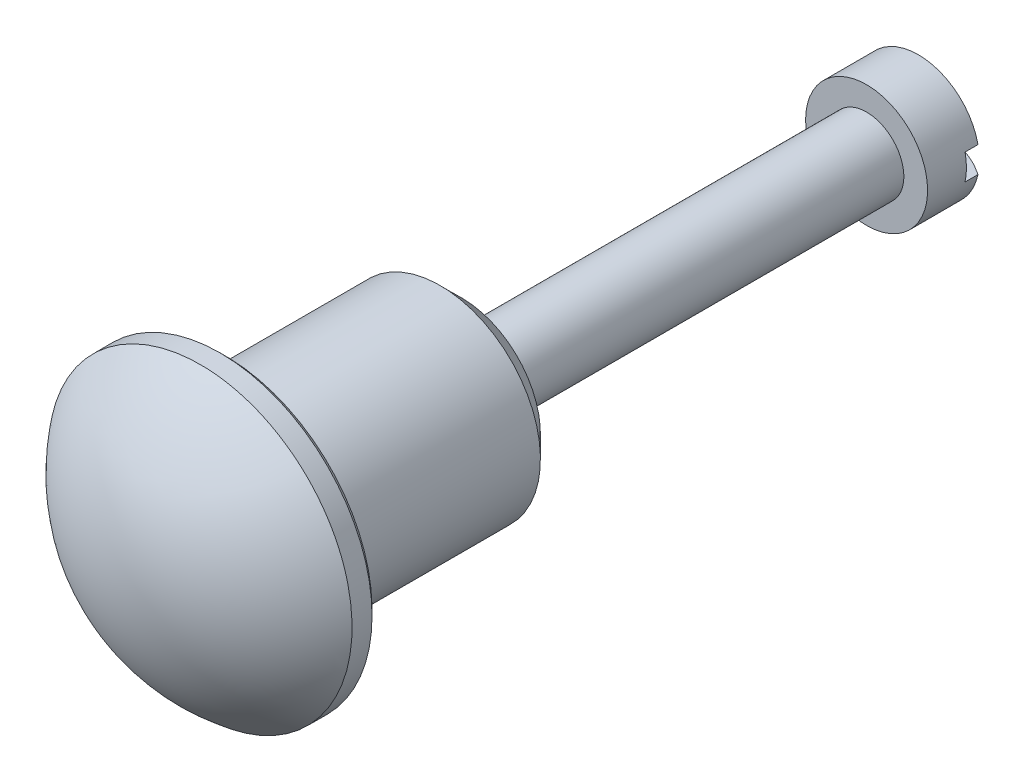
ISO-10303-21;
HEADER;
FILE_DESCRIPTION(('STEP AP214'),'2;1');
FILE_NAME('part.step','',(''),(''),'','','');
FILE_SCHEMA(('AUTOMOTIVE_DESIGN { 1 0 10303 214 1 1 1 1 }'));
ENDSEC;
DATA;
#1=APPLICATION_CONTEXT('core data for automotive mechanical design processes');
#2=APPLICATION_PROTOCOL_DEFINITION('international standard','automotive_design',2000,#1);
#3=PRODUCT_CONTEXT('',#1,'mechanical');
#4=PRODUCT('Part','Part','',(#3));
#5=PRODUCT_RELATED_PRODUCT_CATEGORY('part','',(#4));
#6=PRODUCT_DEFINITION_FORMATION('','',#4);
#7=PRODUCT_DEFINITION_CONTEXT('part definition',#1,'design');
#8=PRODUCT_DEFINITION('design','',#6,#7);
#9=PRODUCT_DEFINITION_SHAPE('','',#8);
#10=(LENGTH_UNIT() NAMED_UNIT(*) SI_UNIT(.MILLI.,.METRE.));
#11=(NAMED_UNIT(*) PLANE_ANGLE_UNIT() SI_UNIT($,.RADIAN.));
#12=(NAMED_UNIT(*) SI_UNIT($,.STERADIAN.) SOLID_ANGLE_UNIT());
#13=UNCERTAINTY_MEASURE_WITH_UNIT(LENGTH_MEASURE(1.E-05),#10,'distance_accuracy_value','');
#14=(GEOMETRIC_REPRESENTATION_CONTEXT(3) GLOBAL_UNCERTAINTY_ASSIGNED_CONTEXT((#13)) GLOBAL_UNIT_ASSIGNED_CONTEXT((#10,
#11,#12)) REPRESENTATION_CONTEXT('',''));
#15=CARTESIAN_POINT('',(0.,0.,0.));
#16=DIRECTION('',(0.,0.,1.));
#17=DIRECTION('',(1.,0.,0.));
#18=AXIS2_PLACEMENT_3D('',#15,#16,#17);
#19=CARTESIAN_POINT('',(0.,0.,-4.17195564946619));
#20=DIRECTION('',(0.635838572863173,0.771822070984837,0.));
#21=DIRECTION('',(0.,0.,-1.));
#22=AXIS2_PLACEMENT_3D('',#19,#20,#21);
#23=SPHERICAL_SURFACE('',#22,8.93445564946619);
#24=CARTESIAN_POINT('',(0.,0.,1.1938));
#25=DIRECTION('',(0.,0.,1.));
#26=DIRECTION('',(-0.635838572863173,-0.771822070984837,0.));
#27=AXIS2_PLACEMENT_3D('',#24,#25,#26);
#28=CIRCLE('',#27,7.14375);
#29=CARTESIAN_POINT('',(-4.54227180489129,-5.51370391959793,1.1938));
#30=VERTEX_POINT('',#29);
#31=EDGE_CURVE('E126',#30,#30,#28,.F.);
#32=ORIENTED_EDGE('',*,*,#31,.F.);
#33=EDGE_LOOP('',(#32));
#34=FACE_BOUND('',#33,.T.);
#35=ADVANCED_FACE('F14',(#34),#23,.T.);
#36=CARTESIAN_POINT('',(0.,0.,4.7625));
#37=DIRECTION('',(0.,0.,1.));
#38=DIRECTION('',(-0.635838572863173,-0.771822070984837,0.));
#39=AXIS2_PLACEMENT_3D('',#36,#37,#38);
#40=CYLINDRICAL_SURFACE('',#39,7.14375);
#41=ORIENTED_EDGE('',*,*,#31,.T.);
#42=EDGE_LOOP('',(#41));
#43=FACE_BOUND('',#42,.T.);
#44=CARTESIAN_POINT('',(0.,0.,0.25400000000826));
#45=DIRECTION('',(0.,0.,1.));
#46=DIRECTION('',(-0.635838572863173,-0.771822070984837,0.));
#47=AXIS2_PLACEMENT_3D('',#44,#45,#46);
#48=CIRCLE('',#47,7.14375000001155);
#49=CARTESIAN_POINT('',(-4.54227180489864,-5.51370391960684,0.254000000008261));
#50=VERTEX_POINT('',#49);
#51=EDGE_CURVE('E123',#50,#50,#48,.F.);
#52=ORIENTED_EDGE('',*,*,#51,.F.);
#53=EDGE_LOOP('',(#52));
#54=FACE_BOUND('',#53,.T.);
#55=ADVANCED_FACE('F84',(#43,#54),#40,.T.);
#56=CARTESIAN_POINT('',(0.,0.,-11.1125));
#57=DIRECTION('',(0.,0.,1.));
#58=DIRECTION('',(-0.635838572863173,-0.771822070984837,0.));
#59=AXIS2_PLACEMENT_3D('',#56,#57,#58);
#60=PLANE('',#59);
#61=CARTESIAN_POINT('',(0.,0.,-11.1125));
#62=DIRECTION('',(0.,0.,1.));
#63=DIRECTION('',(-0.635838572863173,-0.771822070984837,0.));
#64=AXIS2_PLACEMENT_3D('',#61,#62,#63);
#65=CIRCLE('',#64,3.70205000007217);
#66=CARTESIAN_POINT('',(-2.353906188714,-2.85732389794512,-11.1125));
#67=VERTEX_POINT('',#66);
#68=EDGE_CURVE('E119',#67,#67,#65,.T.);
#69=ORIENTED_EDGE('',*,*,#68,.F.);
#70=EDGE_LOOP('',(#69));
#71=FACE_BOUND('',#70,.T.);
#72=CARTESIAN_POINT('',(0.,0.,-11.1125));
#73=DIRECTION('',(0.,0.,-1.));
#74=DIRECTION('',(-1.,0.,0.));
#75=AXIS2_PLACEMENT_3D('',#72,#73,#74);
#76=CIRCLE('',#75,1.7526);
#77=CARTESIAN_POINT('',(-1.7526,0.,-11.1125));
#78=VERTEX_POINT('',#77);
#79=EDGE_CURVE('E9',#78,#78,#76,.F.);
#80=ORIENTED_EDGE('',*,*,#79,.T.);
#81=EDGE_LOOP('',(#80));
#82=FACE_BOUND('',#81,.T.);
#83=ADVANCED_FACE('F91',(#71,#82),#60,.F.);
#84=CARTESIAN_POINT('',(0.,0.,0.2539999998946));
#85=DIRECTION('',(0.,0.,1.));
#86=DIRECTION('',(0.771822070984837,-0.635838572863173,0.));
#87=AXIS2_PLACEMENT_3D('',#84,#85,#86);
#88=CONICAL_SURFACE('',#87,7.14374999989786,0.785398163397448);
#89=ORIENTED_EDGE('',*,*,#51,.T.);
#90=EDGE_LOOP('',(#89));
#91=FACE_BOUND('',#90,.T.);
#92=CARTESIAN_POINT('',(0.,0.,2.42800571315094E-11));
#93=DIRECTION('',(0.,0.,1.));
#94=DIRECTION('',(0.771822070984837,-0.635838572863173,0.));
#95=AXIS2_PLACEMENT_3D('',#92,#93,#94);
#96=CIRCLE('',#95,6.88975000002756);
#97=CARTESIAN_POINT('',(5.31766111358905,-4.38076880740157,2.4279818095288E-11));
#98=VERTEX_POINT('',#97);
#99=EDGE_CURVE('E117',#98,#98,#96,.T.);
#100=ORIENTED_EDGE('',*,*,#99,.T.);
#101=EDGE_LOOP('',(#100));
#102=FACE_BOUND('',#101,.T.);
#103=ADVANCED_FACE('F95',(#91,#102),#88,.T.);
#104=CARTESIAN_POINT('',(0.,0.,-10.096500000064));
#105=DIRECTION('',(0.,0.,1.));
#106=DIRECTION('',(-0.635838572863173,-0.771822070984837,0.));
#107=AXIS2_PLACEMENT_3D('',#104,#105,#106);
#108=CONICAL_SURFACE('',#107,4.71805000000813,0.785398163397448);
#109=ORIENTED_EDGE('',*,*,#68,.T.);
#110=EDGE_LOOP('',(#109));
#111=FACE_BOUND('',#110,.T.);
#112=CARTESIAN_POINT('',(0.,0.,-10.0965));
#113=DIRECTION('',(0.,0.,1.));
#114=DIRECTION('',(-0.635838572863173,-0.771822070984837,0.));
#115=AXIS2_PLACEMENT_3D('',#112,#113,#114);
#116=CIRCLE('',#115,4.71805);
#117=CARTESIAN_POINT('',(-2.99991817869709,-3.64149512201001,-10.0965));
#118=VERTEX_POINT('',#117);
#119=EDGE_CURVE('E78',#118,#118,#116,.T.);
#120=ORIENTED_EDGE('',*,*,#119,.F.);
#121=EDGE_LOOP('',(#120));
#122=FACE_BOUND('',#121,.T.);
#123=ADVANCED_FACE('F99',(#111,#122),#108,.T.);
#124=CARTESIAN_POINT('',(2.99991817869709,3.64149512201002,0.));
#125=DIRECTION('',(0.,0.,1.));
#126=DIRECTION('',(-0.635838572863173,-0.771822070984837,0.));
#127=AXIS2_PLACEMENT_3D('',#124,#125,#126);
#128=PLANE('',#127);
#129=CARTESIAN_POINT('',(0.,0.,0.));
#130=DIRECTION('',(0.,0.,1.));
#131=DIRECTION('',(-0.635838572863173,-0.771822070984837,0.));
#132=AXIS2_PLACEMENT_3D('',#129,#130,#131);
#133=CIRCLE('',#132,4.71805);
#134=CARTESIAN_POINT('',(-2.99991817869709,-3.64149512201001,0.));
#135=VERTEX_POINT('',#134);
#136=EDGE_CURVE('E66',#135,#135,#133,.F.);
#137=ORIENTED_EDGE('',*,*,#136,.F.);
#138=EDGE_LOOP('',(#137));
#139=FACE_BOUND('',#138,.T.);
#140=ORIENTED_EDGE('',*,*,#99,.F.);
#141=EDGE_LOOP('',(#140));
#142=FACE_BOUND('',#141,.T.);
#143=ADVANCED_FACE('F102',(#139,#142),#128,.F.);
#144=CARTESIAN_POINT('',(0.,0.,4.7625));
#145=DIRECTION('',(0.,0.,1.));
#146=DIRECTION('',(-0.635838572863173,-0.771822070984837,0.));
#147=AXIS2_PLACEMENT_3D('',#144,#145,#146);
#148=CYLINDRICAL_SURFACE('',#147,4.71805);
#149=ORIENTED_EDGE('',*,*,#119,.T.);
#150=EDGE_LOOP('',(#149));
#151=FACE_BOUND('',#150,.T.);
#152=ORIENTED_EDGE('',*,*,#136,.T.);
#153=EDGE_LOOP('',(#152));
#154=FACE_BOUND('',#153,.T.);
#155=ADVANCED_FACE('F16',(#151,#154),#148,.T.);
#156=CARTESIAN_POINT('',(0.,0.,-28.5534805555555));
#157=DIRECTION('',(0.,0.,-1.));
#158=DIRECTION('',(0.,1.,0.));
#159=AXIS2_PLACEMENT_3D('',#156,#157,#158);
#160=SPHERICAL_SURFACE('',#159,4.96181944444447);
#161=CARTESIAN_POINT('',(0.,0.,-32.6009));
#162=DIRECTION('',(0.,0.,-1.));
#163=DIRECTION('',(-1.,0.,0.));
#164=AXIS2_PLACEMENT_3D('',#161,#162,#163);
#165=CIRCLE('',#164,2.8702);
#166=CARTESIAN_POINT('',(2.80471672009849,-0.6096,-32.6009));
#167=VERTEX_POINT('',#166);
#168=CARTESIAN_POINT('',(-2.80471672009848,-0.6096,-32.6009));
#169=VERTEX_POINT('',#168);
#170=EDGE_CURVE('E71',#167,#169,#165,.T.);
#171=ORIENTED_EDGE('',*,*,#170,.T.);
#172=CARTESIAN_POINT('',(0.,-0.6096,-28.5534805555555));
#173=DIRECTION('',(0.,1.,0.));
#174=DIRECTION('',(-1.,0.,0.));
#175=AXIS2_PLACEMENT_3D('',#172,#173,#174);
#176=CIRCLE('',#175,4.92422989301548);
#177=EDGE_CURVE('E146',#169,#167,#176,.F.);
#178=ORIENTED_EDGE('',*,*,#177,.T.);
#179=EDGE_LOOP('',(#171,#178));
#180=FACE_BOUND('',#179,.T.);
#181=ADVANCED_FACE('F86',(#180),#160,.T.);
#182=CARTESIAN_POINT('',(-2.80471672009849,0.6096,-32.6009));
#183=VERTEX_POINT('',#182);
#184=CARTESIAN_POINT('',(2.80471672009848,0.6096,-32.6009));
#185=VERTEX_POINT('',#184);
#186=EDGE_CURVE('E154',#183,#185,#165,.T.);
#187=ORIENTED_EDGE('',*,*,#186,.T.);
#188=CARTESIAN_POINT('',(0.,0.6096,-28.5534805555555));
#189=DIRECTION('',(0.,-1.,0.));
#190=DIRECTION('',(1.,0.,0.));
#191=AXIS2_PLACEMENT_3D('',#188,#189,#190);
#192=CIRCLE('',#191,4.92422989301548);
#193=EDGE_CURVE('E150',#185,#183,#192,.F.);
#194=ORIENTED_EDGE('',*,*,#193,.T.);
#195=EDGE_LOOP('',(#187,#194));
#196=FACE_BOUND('',#195,.T.);
#197=ADVANCED_FACE('F164',(#196),#160,.T.);
#198=CARTESIAN_POINT('',(-2.8702,0.6096,-31.9913));
#199=DIRECTION('',(0.,-1.,0.));
#200=DIRECTION('',(1.,0.,0.));
#201=AXIS2_PLACEMENT_3D('',#198,#199,#200);
#202=PLANE('',#201);
#203=DIRECTION('',(0.,0.,-1.));
#204=VECTOR('',#203,1.);
#205=CARTESIAN_POINT('',(-2.80471672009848,0.6096,-58.9153));
#206=LINE('',#205,#204);
#207=CARTESIAN_POINT('',(-2.80471672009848,0.6096,-31.9913));
#208=VERTEX_POINT('',#207);
#209=EDGE_CURVE('E156',#208,#183,#206,.T.);
#210=ORIENTED_EDGE('',*,*,#209,.T.);
#211=ORIENTED_EDGE('',*,*,#193,.F.);
#212=DIRECTION('',(0.,0.,-1.));
#213=VECTOR('',#212,1.);
#214=CARTESIAN_POINT('',(2.80471672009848,0.6096,-58.9153));
#215=LINE('',#214,#213);
#216=CARTESIAN_POINT('',(2.80471672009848,0.6096,-31.9913));
#217=VERTEX_POINT('',#216);
#218=EDGE_CURVE('E59',#185,#217,#215,.F.);
#219=ORIENTED_EDGE('',*,*,#218,.T.);
#220=DIRECTION('',(-1.,0.,0.));
#221=VECTOR('',#220,1.);
#222=CARTESIAN_POINT('',(-2.8702,0.6096,-31.9913));
#223=LINE('',#222,#221);
#224=EDGE_CURVE('E55',#217,#208,#223,.T.);
#225=ORIENTED_EDGE('',*,*,#224,.T.);
#226=EDGE_LOOP('',(#210,#211,#219,#225));
#227=FACE_BOUND('',#226,.T.);
#228=ADVANCED_FACE('F160',(#227),#202,.T.);
#229=CARTESIAN_POINT('',(-2.8702,-0.6096,-31.9913));
#230=DIRECTION('',(0.,0.,-1.));
#231=DIRECTION('',(-1.,0.,0.));
#232=AXIS2_PLACEMENT_3D('',#229,#230,#231);
#233=PLANE('',#232);
#234=ORIENTED_EDGE('',*,*,#224,.F.);
#235=CARTESIAN_POINT('',(0.,0.,-31.9913));
#236=DIRECTION('',(0.,0.,-1.));
#237=DIRECTION('',(-1.,0.,0.));
#238=AXIS2_PLACEMENT_3D('',#235,#236,#237);
#239=CIRCLE('',#238,2.8702);
#240=CARTESIAN_POINT('',(2.80471672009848,-0.6096,-31.9913));
#241=VERTEX_POINT('',#240);
#242=EDGE_CURVE('E52',#217,#241,#239,.T.);
#243=ORIENTED_EDGE('',*,*,#242,.T.);
#244=DIRECTION('',(1.,0.,0.));
#245=VECTOR('',#244,1.);
#246=CARTESIAN_POINT('',(2.8702,-0.6096,-31.9913));
#247=LINE('',#246,#245);
#248=CARTESIAN_POINT('',(-2.80471672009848,-0.6096,-31.9913));
#249=VERTEX_POINT('',#248);
#250=EDGE_CURVE('E29',#249,#241,#247,.T.);
#251=ORIENTED_EDGE('',*,*,#250,.F.);
#252=EDGE_CURVE('E62',#249,#208,#239,.T.);
#253=ORIENTED_EDGE('',*,*,#252,.T.);
#254=EDGE_LOOP('',(#234,#243,#251,#253));
#255=FACE_BOUND('',#254,.T.);
#256=ADVANCED_FACE('F53',(#255),#233,.T.);
#257=CARTESIAN_POINT('',(2.8702,-0.6096,-31.9913));
#258=DIRECTION('',(0.,1.,0.));
#259=DIRECTION('',(-1.,0.,0.));
#260=AXIS2_PLACEMENT_3D('',#257,#258,#259);
#261=PLANE('',#260);
#262=DIRECTION('',(0.,0.,-1.));
#263=VECTOR('',#262,1.);
#264=CARTESIAN_POINT('',(2.80471672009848,-0.6096,-58.9153));
#265=LINE('',#264,#263);
#266=EDGE_CURVE('E22',#241,#167,#265,.T.);
#267=ORIENTED_EDGE('',*,*,#266,.T.);
#268=ORIENTED_EDGE('',*,*,#177,.F.);
#269=DIRECTION('',(0.,0.,-1.));
#270=VECTOR('',#269,1.);
#271=CARTESIAN_POINT('',(-2.80471672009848,-0.6096,-58.9153));
#272=LINE('',#271,#270);
#273=EDGE_CURVE('E60',#169,#249,#272,.F.);
#274=ORIENTED_EDGE('',*,*,#273,.T.);
#275=ORIENTED_EDGE('',*,*,#250,.T.);
#276=EDGE_LOOP('',(#267,#268,#274,#275));
#277=FACE_BOUND('',#276,.T.);
#278=ADVANCED_FACE('F63',(#277),#261,.T.);
#279=CARTESIAN_POINT('',(0.,0.,-58.9153));
#280=DIRECTION('',(0.,0.,-1.));
#281=DIRECTION('',(-1.,0.,0.));
#282=AXIS2_PLACEMENT_3D('',#279,#280,#281);
#283=CYLINDRICAL_SURFACE('',#282,2.8702);
#284=CARTESIAN_POINT('',(0.,0.,-30.1625));
#285=DIRECTION('',(0.,0.,-1.));
#286=DIRECTION('',(-1.,0.,0.));
#287=AXIS2_PLACEMENT_3D('',#284,#285,#286);
#288=CIRCLE('',#287,2.8702);
#289=CARTESIAN_POINT('',(-2.8702,0.,-30.1625));
#290=VERTEX_POINT('',#289);
#291=EDGE_CURVE('E145',#290,#290,#288,.T.);
#292=ORIENTED_EDGE('',*,*,#291,.T.);
#293=EDGE_LOOP('',(#292));
#294=FACE_BOUND('',#293,.T.);
#295=ORIENTED_EDGE('',*,*,#266,.F.);
#296=ORIENTED_EDGE('',*,*,#242,.F.);
#297=ORIENTED_EDGE('',*,*,#218,.F.);
#298=ORIENTED_EDGE('',*,*,#186,.F.);
#299=ORIENTED_EDGE('',*,*,#209,.F.);
#300=ORIENTED_EDGE('',*,*,#252,.F.);
#301=ORIENTED_EDGE('',*,*,#273,.F.);
#302=ORIENTED_EDGE('',*,*,#170,.F.);
#303=EDGE_LOOP('',(#295,#296,#297,#298,#299,#300,#301,#302));
#304=FACE_BOUND('',#303,.T.);
#305=ADVANCED_FACE('F69',(#294,#304),#283,.T.);
#306=CARTESIAN_POINT('',(0.,1.7526,-30.1625));
#307=DIRECTION('',(0.,0.,-1.));
#308=DIRECTION('',(-1.,0.,0.));
#309=AXIS2_PLACEMENT_3D('',#306,#307,#308);
#310=PLANE('',#309);
#311=ORIENTED_EDGE('',*,*,#291,.F.);
#312=EDGE_LOOP('',(#311));
#313=FACE_BOUND('',#312,.T.);
#314=CARTESIAN_POINT('',(0.,0.,-30.1625));
#315=DIRECTION('',(0.,0.,-1.));
#316=DIRECTION('',(-1.,0.,0.));
#317=AXIS2_PLACEMENT_3D('',#314,#315,#316);
#318=CIRCLE('',#317,1.7526);
#319=CARTESIAN_POINT('',(-1.7526,0.,-30.1625));
#320=VERTEX_POINT('',#319);
#321=EDGE_CURVE('E143',#320,#320,#318,.T.);
#322=ORIENTED_EDGE('',*,*,#321,.T.);
#323=EDGE_LOOP('',(#322));
#324=FACE_BOUND('',#323,.T.);
#325=ADVANCED_FACE('F140',(#313,#324),#310,.F.);
#326=CARTESIAN_POINT('',(0.,0.,-58.9153));
#327=DIRECTION('',(0.,0.,-1.));
#328=DIRECTION('',(-1.,0.,0.));
#329=AXIS2_PLACEMENT_3D('',#326,#327,#328);
#330=CYLINDRICAL_SURFACE('',#329,1.7526);
#331=ORIENTED_EDGE('',*,*,#79,.F.);
#332=EDGE_LOOP('',(#331));
#333=FACE_BOUND('',#332,.T.);
#334=ORIENTED_EDGE('',*,*,#321,.F.);
#335=EDGE_LOOP('',(#334));
#336=FACE_BOUND('',#335,.T.);
#337=ADVANCED_FACE('F87',(#333,#336),#330,.T.);
#338=CLOSED_SHELL('',(#35,#55,#83,#103,#123,#143,#155,#181,#197,#228,#256,#278,#305,#325,#337));
#339=MANIFOLD_SOLID_BREP('B1',#338);
#340=ADVANCED_BREP_SHAPE_REPRESENTATION('',(#18,#339),#14);
#341=SHAPE_DEFINITION_REPRESENTATION(#9,#340);
ENDSEC;
END-ISO-10303-21;
